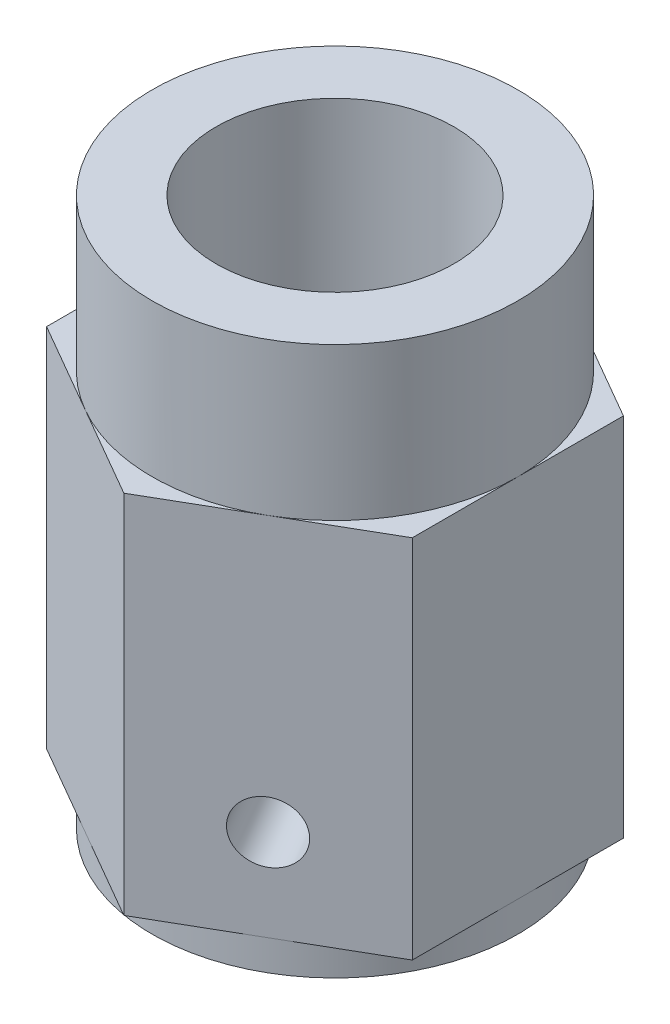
ISO-10303-21;
HEADER;
FILE_DESCRIPTION(('STEP AP214'),'2;1');
FILE_NAME('part.step','',(''),(''),'','','');
FILE_SCHEMA(('AUTOMOTIVE_DESIGN { 1 0 10303 214 1 1 1 1 }'));
ENDSEC;
DATA;
#1=APPLICATION_CONTEXT('core data for automotive mechanical design processes');
#2=APPLICATION_PROTOCOL_DEFINITION('international standard','automotive_design',2000,#1);
#3=PRODUCT_CONTEXT('',#1,'mechanical');
#4=PRODUCT('Part','Part','',(#3));
#5=PRODUCT_RELATED_PRODUCT_CATEGORY('part','',(#4));
#6=PRODUCT_DEFINITION_FORMATION('','',#4);
#7=PRODUCT_DEFINITION_CONTEXT('part definition',#1,'design');
#8=PRODUCT_DEFINITION('design','',#6,#7);
#9=PRODUCT_DEFINITION_SHAPE('','',#8);
#10=(LENGTH_UNIT() NAMED_UNIT(*) SI_UNIT(.MILLI.,.METRE.));
#11=(NAMED_UNIT(*) PLANE_ANGLE_UNIT() SI_UNIT($,.RADIAN.));
#12=(NAMED_UNIT(*) SI_UNIT($,.STERADIAN.) SOLID_ANGLE_UNIT());
#13=UNCERTAINTY_MEASURE_WITH_UNIT(LENGTH_MEASURE(1.E-05),#10,'distance_accuracy_value','');
#14=(GEOMETRIC_REPRESENTATION_CONTEXT(3) GLOBAL_UNCERTAINTY_ASSIGNED_CONTEXT((#13)) GLOBAL_UNIT_ASSIGNED_CONTEXT((#10,
#11,#12)) REPRESENTATION_CONTEXT('',''));
#15=CARTESIAN_POINT('',(0.,0.,0.));
#16=DIRECTION('',(0.,0.,1.));
#17=DIRECTION('',(1.,0.,0.));
#18=AXIS2_PLACEMENT_3D('',#15,#16,#17);
#19=CARTESIAN_POINT('',(0.,0.,0.));
#20=DIRECTION('',(0.,1.,0.));
#21=DIRECTION('',(0.,0.,1.));
#22=AXIS2_PLACEMENT_3D('',#19,#20,#21);
#23=PLANE('',#22);
#24=CARTESIAN_POINT('',(0.,0.,0.));
#25=DIRECTION('',(0.,-1.,0.));
#26=DIRECTION('',(0.,0.,-1.));
#27=AXIS2_PLACEMENT_3D('',#24,#25,#26);
#28=CIRCLE('',#27,30.);
#29=CARTESIAN_POINT('',(15.,0.,-25.9807621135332));
#30=VERTEX_POINT('',#29);
#31=CARTESIAN_POINT('',(30.,0.,0.));
#32=VERTEX_POINT('',#31);
#33=EDGE_CURVE('E49',#30,#32,#28,.T.);
#34=ORIENTED_EDGE('',*,*,#33,.F.);
#35=DIRECTION('',(-0.866025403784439,0.,-0.5));
#36=VECTOR('',#35,1.);
#37=CARTESIAN_POINT('',(30.,0.,-17.3205080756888));
#38=LINE('',#37,#36);
#39=CARTESIAN_POINT('',(30.,0.,-17.3205080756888));
#40=VERTEX_POINT('',#39);
#41=EDGE_CURVE('E133',#40,#30,#38,.T.);
#42=ORIENTED_EDGE('',*,*,#41,.F.);
#43=DIRECTION('',(0.,0.,-1.));
#44=VECTOR('',#43,1.);
#45=CARTESIAN_POINT('',(30.,0.,17.3205080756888));
#46=LINE('',#45,#44);
#47=EDGE_CURVE('E150',#32,#40,#46,.T.);
#48=ORIENTED_EDGE('',*,*,#47,.F.);
#49=EDGE_LOOP('',(#34,#42,#48));
#50=FACE_BOUND('',#49,.T.);
#51=ADVANCED_FACE('F38',(#50),#23,.F.);
#52=CARTESIAN_POINT('',(15.,0.,25.9807621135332));
#53=VERTEX_POINT('',#52);
#54=EDGE_CURVE('E11',#32,#53,#28,.T.);
#55=ORIENTED_EDGE('',*,*,#54,.F.);
#56=CARTESIAN_POINT('',(30.,0.,17.3205080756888));
#57=VERTEX_POINT('',#56);
#58=EDGE_CURVE('E206',#57,#32,#46,.T.);
#59=ORIENTED_EDGE('',*,*,#58,.F.);
#60=DIRECTION('',(0.866025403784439,0.,-0.5));
#61=VECTOR('',#60,1.);
#62=CARTESIAN_POINT('',(0.,0.,34.6410161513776));
#63=LINE('',#62,#61);
#64=EDGE_CURVE('E202',#53,#57,#63,.T.);
#65=ORIENTED_EDGE('',*,*,#64,.F.);
#66=EDGE_LOOP('',(#55,#59,#65));
#67=FACE_BOUND('',#66,.T.);
#68=ADVANCED_FACE('F245',(#67),#23,.F.);
#69=CARTESIAN_POINT('',(-15.,0.,25.9807621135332));
#70=VERTEX_POINT('',#69);
#71=EDGE_CURVE('E47',#53,#70,#28,.T.);
#72=ORIENTED_EDGE('',*,*,#71,.F.);
#73=CARTESIAN_POINT('',(0.,0.,34.6410161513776));
#74=VERTEX_POINT('',#73);
#75=EDGE_CURVE('E203',#74,#53,#63,.T.);
#76=ORIENTED_EDGE('',*,*,#75,.F.);
#77=DIRECTION('',(0.866025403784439,0.,0.5));
#78=VECTOR('',#77,1.);
#79=CARTESIAN_POINT('',(-30.,0.,17.3205080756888));
#80=LINE('',#79,#78);
#81=EDGE_CURVE('E198',#70,#74,#80,.T.);
#82=ORIENTED_EDGE('',*,*,#81,.F.);
#83=EDGE_LOOP('',(#72,#76,#82));
#84=FACE_BOUND('',#83,.T.);
#85=ADVANCED_FACE('F250',(#84),#23,.F.);
#86=CARTESIAN_POINT('',(-30.,0.,0.));
#87=VERTEX_POINT('',#86);
#88=EDGE_CURVE('E158',#70,#87,#28,.T.);
#89=ORIENTED_EDGE('',*,*,#88,.F.);
#90=CARTESIAN_POINT('',(-30.,0.,17.3205080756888));
#91=VERTEX_POINT('',#90);
#92=EDGE_CURVE('E199',#91,#70,#80,.T.);
#93=ORIENTED_EDGE('',*,*,#92,.F.);
#94=DIRECTION('',(0.,0.,1.));
#95=VECTOR('',#94,1.);
#96=CARTESIAN_POINT('',(-30.,0.,-17.3205080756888));
#97=LINE('',#96,#95);
#98=EDGE_CURVE('E194',#87,#91,#97,.T.);
#99=ORIENTED_EDGE('',*,*,#98,.F.);
#100=EDGE_LOOP('',(#89,#93,#99));
#101=FACE_BOUND('',#100,.T.);
#102=ADVANCED_FACE('F258',(#101),#23,.F.);
#103=CARTESIAN_POINT('',(-15.,0.,-25.9807621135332));
#104=VERTEX_POINT('',#103);
#105=EDGE_CURVE('E63',#87,#104,#28,.T.);
#106=ORIENTED_EDGE('',*,*,#105,.F.);
#107=CARTESIAN_POINT('',(-30.,0.,-17.3205080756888));
#108=VERTEX_POINT('',#107);
#109=EDGE_CURVE('E195',#108,#87,#97,.T.);
#110=ORIENTED_EDGE('',*,*,#109,.F.);
#111=DIRECTION('',(-0.866025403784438,0.,0.5));
#112=VECTOR('',#111,1.);
#113=CARTESIAN_POINT('',(0.,0.,-34.6410161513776));
#114=LINE('',#113,#112);
#115=EDGE_CURVE('E142',#104,#108,#114,.T.);
#116=ORIENTED_EDGE('',*,*,#115,.F.);
#117=EDGE_LOOP('',(#106,#110,#116));
#118=FACE_BOUND('',#117,.T.);
#119=ADVANCED_FACE('F260',(#118),#23,.F.);
#120=CARTESIAN_POINT('',(0.,60.,0.));
#121=DIRECTION('',(0.,1.,0.));
#122=DIRECTION('',(0.,0.,1.));
#123=AXIS2_PLACEMENT_3D('',#120,#121,#122);
#124=PLANE('',#123);
#125=CARTESIAN_POINT('',(0.,60.,0.));
#126=DIRECTION('',(0.,1.,0.));
#127=DIRECTION('',(0.,0.,1.));
#128=AXIS2_PLACEMENT_3D('',#125,#126,#127);
#129=CIRCLE('',#128,30.);
#130=CARTESIAN_POINT('',(15.,60.,25.9807621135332));
#131=VERTEX_POINT('',#130);
#132=CARTESIAN_POINT('',(30.,60.,0.));
#133=VERTEX_POINT('',#132);
#134=EDGE_CURVE('E162',#131,#133,#129,.T.);
#135=ORIENTED_EDGE('',*,*,#134,.F.);
#136=DIRECTION('',(0.866025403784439,0.,-0.5));
#137=VECTOR('',#136,1.);
#138=CARTESIAN_POINT('',(0.,60.,34.6410161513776));
#139=LINE('',#138,#137);
#140=CARTESIAN_POINT('',(30.,60.,17.3205080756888));
#141=VERTEX_POINT('',#140);
#142=EDGE_CURVE('E186',#131,#141,#139,.T.);
#143=ORIENTED_EDGE('',*,*,#142,.T.);
#144=DIRECTION('',(0.,0.,-1.));
#145=VECTOR('',#144,1.);
#146=CARTESIAN_POINT('',(30.,60.,17.3205080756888));
#147=LINE('',#146,#145);
#148=EDGE_CURVE('E190',#141,#133,#147,.T.);
#149=ORIENTED_EDGE('',*,*,#148,.T.);
#150=EDGE_LOOP('',(#135,#143,#149));
#151=FACE_BOUND('',#150,.T.);
#152=ADVANCED_FACE('F288',(#151),#124,.T.);
#153=CARTESIAN_POINT('',(15.,60.,-25.9807621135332));
#154=VERTEX_POINT('',#153);
#155=EDGE_CURVE('E157',#133,#154,#129,.T.);
#156=ORIENTED_EDGE('',*,*,#155,.F.);
#157=CARTESIAN_POINT('',(30.,60.,-17.3205080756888));
#158=VERTEX_POINT('',#157);
#159=EDGE_CURVE('E189',#133,#158,#147,.T.);
#160=ORIENTED_EDGE('',*,*,#159,.T.);
#161=DIRECTION('',(-0.866025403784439,0.,-0.5));
#162=VECTOR('',#161,1.);
#163=CARTESIAN_POINT('',(30.,60.,-17.3205080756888));
#164=LINE('',#163,#162);
#165=EDGE_CURVE('E170',#158,#154,#164,.T.);
#166=ORIENTED_EDGE('',*,*,#165,.T.);
#167=EDGE_LOOP('',(#156,#160,#166));
#168=FACE_BOUND('',#167,.T.);
#169=ADVANCED_FACE('F236',(#168),#124,.T.);
#170=CARTESIAN_POINT('',(-15.,60.,-25.9807621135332));
#171=VERTEX_POINT('',#170);
#172=EDGE_CURVE('E160',#154,#171,#129,.T.);
#173=ORIENTED_EDGE('',*,*,#172,.F.);
#174=CARTESIAN_POINT('',(0.,60.,-34.6410161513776));
#175=VERTEX_POINT('',#174);
#176=EDGE_CURVE('E174',#154,#175,#164,.T.);
#177=ORIENTED_EDGE('',*,*,#176,.T.);
#178=DIRECTION('',(-0.866025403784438,0.,0.5));
#179=VECTOR('',#178,1.);
#180=CARTESIAN_POINT('',(0.,60.,-34.6410161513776));
#181=LINE('',#180,#179);
#182=EDGE_CURVE('E175',#175,#171,#181,.T.);
#183=ORIENTED_EDGE('',*,*,#182,.T.);
#184=EDGE_LOOP('',(#173,#177,#183));
#185=FACE_BOUND('',#184,.T.);
#186=ADVANCED_FACE('F234',(#185),#124,.T.);
#187=CARTESIAN_POINT('',(-30.,60.,0.));
#188=VERTEX_POINT('',#187);
#189=EDGE_CURVE('E228',#171,#188,#129,.T.);
#190=ORIENTED_EDGE('',*,*,#189,.F.);
#191=CARTESIAN_POINT('',(-30.,60.,-17.3205080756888));
#192=VERTEX_POINT('',#191);
#193=EDGE_CURVE('E173',#171,#192,#181,.T.);
#194=ORIENTED_EDGE('',*,*,#193,.T.);
#195=DIRECTION('',(0.,0.,1.));
#196=VECTOR('',#195,1.);
#197=CARTESIAN_POINT('',(-30.,60.,-17.3205080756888));
#198=LINE('',#197,#196);
#199=EDGE_CURVE('E179',#192,#188,#198,.T.);
#200=ORIENTED_EDGE('',*,*,#199,.T.);
#201=EDGE_LOOP('',(#190,#194,#200));
#202=FACE_BOUND('',#201,.T.);
#203=ADVANCED_FACE('F336',(#202),#124,.T.);
#204=CARTESIAN_POINT('',(-15.,60.,25.9807621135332));
#205=VERTEX_POINT('',#204);
#206=EDGE_CURVE('E225',#188,#205,#129,.T.);
#207=ORIENTED_EDGE('',*,*,#206,.F.);
#208=CARTESIAN_POINT('',(-30.,60.,17.3205080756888));
#209=VERTEX_POINT('',#208);
#210=EDGE_CURVE('E178',#188,#209,#198,.T.);
#211=ORIENTED_EDGE('',*,*,#210,.T.);
#212=DIRECTION('',(0.866025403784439,0.,0.5));
#213=VECTOR('',#212,1.);
#214=CARTESIAN_POINT('',(-30.,60.,17.3205080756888));
#215=LINE('',#214,#213);
#216=EDGE_CURVE('E183',#209,#205,#215,.T.);
#217=ORIENTED_EDGE('',*,*,#216,.T.);
#218=EDGE_LOOP('',(#207,#211,#217));
#219=FACE_BOUND('',#218,.T.);
#220=ADVANCED_FACE('F269',(#219),#124,.T.);
#221=CARTESIAN_POINT('',(30.,60.,-17.3205080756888));
#222=DIRECTION('',(-0.5,0.,0.866025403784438));
#223=DIRECTION('',(0.866025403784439,0.,0.5));
#224=AXIS2_PLACEMENT_3D('',#221,#222,#223);
#225=PLANE('',#224);
#226=CARTESIAN_POINT('',(15.,15.,-25.9807621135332));
#227=DIRECTION('',(0.5,0.,-0.866025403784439));
#228=DIRECTION('',(-0.866025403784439,0.,-0.5));
#229=AXIS2_PLACEMENT_3D('',#226,#227,#228);
#230=CIRCLE('',#229,5.);
#231=CARTESIAN_POINT('',(10.6698729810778,15.,-28.4807621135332));
#232=VERTEX_POINT('',#231);
#233=EDGE_CURVE('E451',#232,#232,#230,.T.);
#234=ORIENTED_EDGE('',*,*,#233,.F.);
#235=EDGE_LOOP('',(#234));
#236=FACE_BOUND('',#235,.T.);
#237=ORIENTED_EDGE('',*,*,#41,.T.);
#238=CARTESIAN_POINT('',(0.,0.,-34.6410161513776));
#239=VERTEX_POINT('',#238);
#240=EDGE_CURVE('E135',#30,#239,#38,.T.);
#241=ORIENTED_EDGE('',*,*,#240,.T.);
#242=DIRECTION('',(0.,-1.,0.));
#243=VECTOR('',#242,1.);
#244=CARTESIAN_POINT('',(0.,60.,-34.6410161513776));
#245=LINE('',#244,#243);
#246=EDGE_CURVE('E42',#175,#239,#245,.T.);
#247=ORIENTED_EDGE('',*,*,#246,.F.);
#248=ORIENTED_EDGE('',*,*,#176,.F.);
#249=ORIENTED_EDGE('',*,*,#165,.F.);
#250=DIRECTION('',(0.,-1.,0.));
#251=VECTOR('',#250,1.);
#252=CARTESIAN_POINT('',(30.,60.,-17.3205080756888));
#253=LINE('',#252,#251);
#254=EDGE_CURVE('E138',#158,#40,#253,.T.);
#255=ORIENTED_EDGE('',*,*,#254,.T.);
#256=EDGE_LOOP('',(#237,#241,#247,#248,#249,#255));
#257=FACE_BOUND('',#256,.T.);
#258=ADVANCED_FACE('F40',(#236,#257),#225,.F.);
#259=CARTESIAN_POINT('',(0.,60.,-34.6410161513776));
#260=DIRECTION('',(0.5,0.,0.866025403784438));
#261=DIRECTION('',(0.866025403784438,0.,-0.5));
#262=AXIS2_PLACEMENT_3D('',#259,#260,#261);
#263=PLANE('',#262);
#264=EDGE_CURVE('E146',#239,#104,#114,.T.);
#265=ORIENTED_EDGE('',*,*,#264,.T.);
#266=ORIENTED_EDGE('',*,*,#115,.T.);
#267=DIRECTION('',(0.,-1.,0.));
#268=VECTOR('',#267,1.);
#269=CARTESIAN_POINT('',(-30.,60.,-17.3205080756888));
#270=LINE('',#269,#268);
#271=EDGE_CURVE('E217',#192,#108,#270,.T.);
#272=ORIENTED_EDGE('',*,*,#271,.F.);
#273=ORIENTED_EDGE('',*,*,#193,.F.);
#274=ORIENTED_EDGE('',*,*,#182,.F.);
#275=ORIENTED_EDGE('',*,*,#246,.T.);
#276=EDGE_LOOP('',(#265,#266,#272,#273,#274,#275));
#277=FACE_BOUND('',#276,.T.);
#278=ADVANCED_FACE('F261',(#277),#263,.F.);
#279=CARTESIAN_POINT('',(-30.,60.,-17.3205080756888));
#280=DIRECTION('',(1.,0.,0.));
#281=DIRECTION('',(0.,0.,-1.));
#282=AXIS2_PLACEMENT_3D('',#279,#280,#281);
#283=PLANE('',#282);
#284=CARTESIAN_POINT('',(-30.,15.,0.));
#285=DIRECTION('',(-1.,0.,0.));
#286=DIRECTION('',(0.,0.,1.));
#287=AXIS2_PLACEMENT_3D('',#284,#285,#286);
#288=CIRCLE('',#287,5.);
#289=CARTESIAN_POINT('',(-30.,15.,5.));
#290=VERTEX_POINT('',#289);
#291=EDGE_CURVE('E405',#290,#290,#288,.T.);
#292=ORIENTED_EDGE('',*,*,#291,.F.);
#293=EDGE_LOOP('',(#292));
#294=FACE_BOUND('',#293,.T.);
#295=ORIENTED_EDGE('',*,*,#109,.T.);
#296=ORIENTED_EDGE('',*,*,#98,.T.);
#297=DIRECTION('',(0.,-1.,0.));
#298=VECTOR('',#297,1.);
#299=CARTESIAN_POINT('',(-30.,60.,17.3205080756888));
#300=LINE('',#299,#298);
#301=EDGE_CURVE('E215',#209,#91,#300,.T.);
#302=ORIENTED_EDGE('',*,*,#301,.F.);
#303=ORIENTED_EDGE('',*,*,#210,.F.);
#304=ORIENTED_EDGE('',*,*,#199,.F.);
#305=ORIENTED_EDGE('',*,*,#271,.T.);
#306=EDGE_LOOP('',(#295,#296,#302,#303,#304,#305));
#307=FACE_BOUND('',#306,.T.);
#308=ADVANCED_FACE('F259',(#294,#307),#283,.F.);
#309=CARTESIAN_POINT('',(-30.,60.,17.3205080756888));
#310=DIRECTION('',(0.5,0.,-0.866025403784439));
#311=DIRECTION('',(-0.866025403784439,0.,-0.5));
#312=AXIS2_PLACEMENT_3D('',#309,#310,#311);
#313=PLANE('',#312);
#314=ORIENTED_EDGE('',*,*,#92,.T.);
#315=ORIENTED_EDGE('',*,*,#81,.T.);
#316=DIRECTION('',(0.,-1.,0.));
#317=VECTOR('',#316,1.);
#318=CARTESIAN_POINT('',(0.,60.,34.6410161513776));
#319=LINE('',#318,#317);
#320=CARTESIAN_POINT('',(0.,60.,34.6410161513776));
#321=VERTEX_POINT('',#320);
#322=EDGE_CURVE('E212',#321,#74,#319,.T.);
#323=ORIENTED_EDGE('',*,*,#322,.F.);
#324=EDGE_CURVE('E182',#205,#321,#215,.T.);
#325=ORIENTED_EDGE('',*,*,#324,.F.);
#326=ORIENTED_EDGE('',*,*,#216,.F.);
#327=ORIENTED_EDGE('',*,*,#301,.T.);
#328=EDGE_LOOP('',(#314,#315,#323,#325,#326,#327));
#329=FACE_BOUND('',#328,.T.);
#330=ADVANCED_FACE('F254',(#329),#313,.F.);
#331=CARTESIAN_POINT('',(0.,60.,34.6410161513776));
#332=DIRECTION('',(-0.5,0.,-0.866025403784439));
#333=DIRECTION('',(-0.866025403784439,0.,0.5));
#334=AXIS2_PLACEMENT_3D('',#331,#332,#333);
#335=PLANE('',#334);
#336=CARTESIAN_POINT('',(15.,15.,25.9807621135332));
#337=DIRECTION('',(0.5,0.,0.866025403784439));
#338=DIRECTION('',(0.866025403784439,0.,-0.5));
#339=AXIS2_PLACEMENT_3D('',#336,#337,#338);
#340=CIRCLE('',#339,5.);
#341=CARTESIAN_POINT('',(19.3301270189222,15.,23.4807621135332));
#342=VERTEX_POINT('',#341);
#343=EDGE_CURVE('E435',#342,#342,#340,.T.);
#344=ORIENTED_EDGE('',*,*,#343,.F.);
#345=EDGE_LOOP('',(#344));
#346=FACE_BOUND('',#345,.T.);
#347=ORIENTED_EDGE('',*,*,#75,.T.);
#348=ORIENTED_EDGE('',*,*,#64,.T.);
#349=DIRECTION('',(0.,-1.,0.));
#350=VECTOR('',#349,1.);
#351=CARTESIAN_POINT('',(30.,60.,17.3205080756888));
#352=LINE('',#351,#350);
#353=EDGE_CURVE('E209',#141,#57,#352,.T.);
#354=ORIENTED_EDGE('',*,*,#353,.F.);
#355=ORIENTED_EDGE('',*,*,#142,.F.);
#356=EDGE_CURVE('E187',#321,#131,#139,.T.);
#357=ORIENTED_EDGE('',*,*,#356,.F.);
#358=ORIENTED_EDGE('',*,*,#322,.T.);
#359=EDGE_LOOP('',(#347,#348,#354,#355,#357,#358));
#360=FACE_BOUND('',#359,.T.);
#361=ADVANCED_FACE('F460',(#346,#360),#335,.F.);
#362=CARTESIAN_POINT('',(30.,60.,17.3205080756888));
#363=DIRECTION('',(-1.,0.,0.));
#364=DIRECTION('',(0.,0.,1.));
#365=AXIS2_PLACEMENT_3D('',#362,#363,#364);
#366=PLANE('',#365);
#367=ORIENTED_EDGE('',*,*,#58,.T.);
#368=ORIENTED_EDGE('',*,*,#47,.T.);
#369=ORIENTED_EDGE('',*,*,#254,.F.);
#370=ORIENTED_EDGE('',*,*,#159,.F.);
#371=ORIENTED_EDGE('',*,*,#148,.F.);
#372=ORIENTED_EDGE('',*,*,#353,.T.);
#373=EDGE_LOOP('',(#367,#368,#369,#370,#371,#372));
#374=FACE_BOUND('',#373,.T.);
#375=ADVANCED_FACE('F240',(#374),#366,.F.);
#376=EDGE_CURVE('E169',#205,#131,#129,.T.);
#377=ORIENTED_EDGE('',*,*,#376,.F.);
#378=ORIENTED_EDGE('',*,*,#324,.T.);
#379=ORIENTED_EDGE('',*,*,#356,.T.);
#380=EDGE_LOOP('',(#377,#378,#379));
#381=FACE_BOUND('',#380,.T.);
#382=ADVANCED_FACE('F279',(#381),#124,.T.);
#383=EDGE_CURVE('E56',#104,#30,#28,.T.);
#384=ORIENTED_EDGE('',*,*,#383,.F.);
#385=ORIENTED_EDGE('',*,*,#264,.F.);
#386=ORIENTED_EDGE('',*,*,#240,.F.);
#387=EDGE_LOOP('',(#384,#385,#386));
#388=FACE_BOUND('',#387,.T.);
#389=ADVANCED_FACE('F144',(#388),#23,.F.);
#390=CARTESIAN_POINT('',(0.,85.,0.));
#391=DIRECTION('',(0.,-1.,0.));
#392=DIRECTION('',(0.,0.,-1.));
#393=AXIS2_PLACEMENT_3D('',#390,#391,#392);
#394=CYLINDRICAL_SURFACE('',#393,30.);
#395=CARTESIAN_POINT('',(0.,85.,0.));
#396=DIRECTION('',(0.,1.,0.));
#397=DIRECTION('',(0.,0.,1.));
#398=AXIS2_PLACEMENT_3D('',#395,#396,#397);
#399=CIRCLE('',#398,30.);
#400=CARTESIAN_POINT('',(0.,85.,30.));
#401=VERTEX_POINT('',#400);
#402=EDGE_CURVE('E148',#401,#401,#399,.T.);
#403=ORIENTED_EDGE('',*,*,#402,.F.);
#404=EDGE_LOOP('',(#403));
#405=FACE_BOUND('',#404,.T.);
#406=ORIENTED_EDGE('',*,*,#134,.T.);
#407=ORIENTED_EDGE('',*,*,#155,.T.);
#408=ORIENTED_EDGE('',*,*,#172,.T.);
#409=ORIENTED_EDGE('',*,*,#189,.T.);
#410=ORIENTED_EDGE('',*,*,#206,.T.);
#411=ORIENTED_EDGE('',*,*,#376,.T.);
#412=EDGE_LOOP('',(#406,#407,#408,#409,#410,#411));
#413=FACE_BOUND('',#412,.T.);
#414=ADVANCED_FACE('F231',(#405,#413),#394,.T.);
#415=CARTESIAN_POINT('',(0.,85.,0.));
#416=DIRECTION('',(0.,1.,0.));
#417=DIRECTION('',(0.,0.,1.));
#418=AXIS2_PLACEMENT_3D('',#415,#416,#417);
#419=PLANE('',#418);
#420=CARTESIAN_POINT('',(0.,85.,0.));
#421=DIRECTION('',(0.,1.,0.));
#422=DIRECTION('',(0.,0.,1.));
#423=AXIS2_PLACEMENT_3D('',#420,#421,#422);
#424=CIRCLE('',#423,19.5);
#425=CARTESIAN_POINT('',(0.,85.,19.5));
#426=VERTEX_POINT('',#425);
#427=EDGE_CURVE('E404',#426,#426,#424,.T.);
#428=ORIENTED_EDGE('',*,*,#427,.F.);
#429=EDGE_LOOP('',(#428));
#430=FACE_BOUND('',#429,.T.);
#431=ORIENTED_EDGE('',*,*,#402,.T.);
#432=EDGE_LOOP('',(#431));
#433=FACE_BOUND('',#432,.T.);
#434=ADVANCED_FACE('F284',(#430,#433),#419,.T.);
#435=CARTESIAN_POINT('',(0.,-5.,0.));
#436=DIRECTION('',(0.,1.,0.));
#437=DIRECTION('',(0.,0.,1.));
#438=AXIS2_PLACEMENT_3D('',#435,#436,#437);
#439=CYLINDRICAL_SURFACE('',#438,30.);
#440=CARTESIAN_POINT('',(0.,-5.,0.));
#441=DIRECTION('',(0.,-1.,0.));
#442=DIRECTION('',(0.,0.,-1.));
#443=AXIS2_PLACEMENT_3D('',#440,#441,#442);
#444=CIRCLE('',#443,30.);
#445=CARTESIAN_POINT('',(0.,-5.,-30.));
#446=VERTEX_POINT('',#445);
#447=EDGE_CURVE('E153',#446,#446,#444,.T.);
#448=ORIENTED_EDGE('',*,*,#447,.F.);
#449=EDGE_LOOP('',(#448));
#450=FACE_BOUND('',#449,.T.);
#451=ORIENTED_EDGE('',*,*,#33,.T.);
#452=ORIENTED_EDGE('',*,*,#54,.T.);
#453=ORIENTED_EDGE('',*,*,#71,.T.);
#454=ORIENTED_EDGE('',*,*,#88,.T.);
#455=ORIENTED_EDGE('',*,*,#105,.T.);
#456=ORIENTED_EDGE('',*,*,#383,.T.);
#457=EDGE_LOOP('',(#451,#452,#453,#454,#455,#456));
#458=FACE_BOUND('',#457,.T.);
#459=ADVANCED_FACE('F155',(#450,#458),#439,.T.);
#460=CARTESIAN_POINT('',(0.,-5.,0.));
#461=DIRECTION('',(0.,-1.,0.));
#462=DIRECTION('',(0.,0.,-1.));
#463=AXIS2_PLACEMENT_3D('',#460,#461,#462);
#464=PLANE('',#463);
#465=CARTESIAN_POINT('',(0.,-5.,0.));
#466=DIRECTION('',(0.,-1.,0.));
#467=DIRECTION('',(0.,0.,-1.));
#468=AXIS2_PLACEMENT_3D('',#465,#466,#467);
#469=CIRCLE('',#468,15.);
#470=CARTESIAN_POINT('',(0.,-5.,-15.));
#471=VERTEX_POINT('',#470);
#472=EDGE_CURVE('E154',#471,#471,#469,.T.);
#473=ORIENTED_EDGE('',*,*,#472,.F.);
#474=EDGE_LOOP('',(#473));
#475=FACE_BOUND('',#474,.T.);
#476=ORIENTED_EDGE('',*,*,#447,.T.);
#477=EDGE_LOOP('',(#476));
#478=FACE_BOUND('',#477,.T.);
#479=ADVANCED_FACE('F372',(#475,#478),#464,.T.);
#480=CARTESIAN_POINT('',(0.,40.,0.));
#481=DIRECTION('',(0.,-1.,0.));
#482=DIRECTION('',(0.,0.,-1.));
#483=AXIS2_PLACEMENT_3D('',#480,#481,#482);
#484=CYLINDRICAL_SURFACE('',#483,15.);
#485=CARTESIAN_POINT('',(2.74094079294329,15.,-14.7474487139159));
#486=CARTESIAN_POINT('',(2.7409392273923,14.7276591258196,-14.7474485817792));
#487=CARTESIAN_POINT('',(2.7642521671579,14.455326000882,-14.7431730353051));
#488=CARTESIAN_POINT('',(2.85621974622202,13.9187278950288,-14.7256290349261));
#489=CARTESIAN_POINT('',(2.92488185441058,13.6544642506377,-14.7123590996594));
#490=CARTESIAN_POINT('',(3.10387971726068,13.1418655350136,-14.6756322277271));
#491=CARTESIAN_POINT('',(3.21413379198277,12.8935003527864,-14.6521952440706));
#492=CARTESIAN_POINT('',(3.47146220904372,12.4181997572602,-14.5933652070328));
#493=CARTESIAN_POINT('',(3.61854467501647,12.1912690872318,-14.5579695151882));
#494=CARTESIAN_POINT('',(3.94975384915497,11.7564001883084,-14.4716858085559));
#495=CARTESIAN_POINT('',(4.13501077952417,11.5494228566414,-14.42029217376));
#496=CARTESIAN_POINT('',(4.53246809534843,11.1689659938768,-14.3003416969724));
#497=CARTESIAN_POINT('',(4.74467279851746,10.9954918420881,-14.231782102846));
#498=CARTESIAN_POINT('',(5.19485467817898,10.682605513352,-14.073797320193));
#499=CARTESIAN_POINT('',(5.43335983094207,10.5442001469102,-13.9838743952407));
#500=CARTESIAN_POINT('',(5.92316770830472,10.3120420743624,-13.7835396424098));
#501=CARTESIAN_POINT('',(6.1744669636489,10.2182773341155,-13.6731333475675));
#502=CARTESIAN_POINT('',(6.67228822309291,10.081320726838,-13.4370303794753));
#503=CARTESIAN_POINT('',(6.91867222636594,10.036482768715,-13.3119993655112));
#504=CARTESIAN_POINT('',(7.40713565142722,9.9934185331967,-13.0465140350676));
#505=CARTESIAN_POINT('',(7.64921616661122,9.99518024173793,-12.9060637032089));
#506=CARTESIAN_POINT('',(8.11230738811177,10.0442212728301,-12.6198934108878));
#507=CARTESIAN_POINT('',(8.33377208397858,10.0897126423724,-12.4745961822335));
#508=CARTESIAN_POINT('',(8.76030230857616,10.2219649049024,-12.1788542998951));
#509=CARTESIAN_POINT('',(8.96536672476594,10.3087285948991,-12.0284092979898));
#510=CARTESIAN_POINT('',(9.35744889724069,10.5221065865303,-11.7260521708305));
#511=CARTESIAN_POINT('',(9.54419402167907,10.6492296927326,-11.5741467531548));
#512=CARTESIAN_POINT('',(9.89358657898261,10.9392985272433,-11.2769513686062));
#513=CARTESIAN_POINT('',(10.0562272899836,11.1022542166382,-11.1316632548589));
#514=CARTESIAN_POINT('',(10.3624817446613,11.4683719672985,-10.8473362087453));
#515=CARTESIAN_POINT('',(10.5048391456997,11.6730657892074,-10.7089135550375));
#516=CARTESIAN_POINT('',(10.7594278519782,12.1122436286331,-10.4531031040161));
#517=CARTESIAN_POINT('',(10.8716545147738,12.3467322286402,-10.3357185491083));
#518=CARTESIAN_POINT('',(11.0661436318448,12.8432681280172,-10.1272484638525));
#519=CARTESIAN_POINT('',(11.1479560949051,13.1056606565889,-10.0365617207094));
#520=CARTESIAN_POINT('',(11.2782028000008,13.6478569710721,-9.88998833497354));
#521=CARTESIAN_POINT('',(11.326651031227,13.9276534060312,-9.83408710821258));
#522=CARTESIAN_POINT('',(11.3879957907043,14.4831917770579,-9.76297448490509));
#523=CARTESIAN_POINT('',(11.4023976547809,14.7585471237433,-9.74604111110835));
#524=CARTESIAN_POINT('',(11.3998353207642,15.3088807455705,-9.74903958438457));
#525=CARTESIAN_POINT('',(11.3828768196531,15.5838590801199,-9.76896473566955));
#526=CARTESIAN_POINT('',(11.3190215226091,16.1157848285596,-9.84286385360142));
#527=CARTESIAN_POINT('',(11.2731731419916,16.3730271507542,-9.89564470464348));
#528=CARTESIAN_POINT('',(11.1531628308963,16.8727180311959,-10.0307060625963));
#529=CARTESIAN_POINT('',(11.0789958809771,17.1151639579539,-10.1129917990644));
#530=CARTESIAN_POINT('',(10.9003947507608,17.586902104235,-10.3052941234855));
#531=CARTESIAN_POINT('',(10.7950751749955,17.815533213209,-10.4161074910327));
#532=CARTESIAN_POINT('',(10.5562368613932,18.2457302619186,-10.6580822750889));
#533=CARTESIAN_POINT('',(10.4227098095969,18.4472881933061,-10.7892496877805));
#534=CARTESIAN_POINT('',(10.121669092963,18.8276399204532,-11.0723280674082));
#535=CARTESIAN_POINT('',(9.95282935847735,19.0048719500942,-11.2249334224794));
#536=CARTESIAN_POINT('',(9.58779783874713,19.3195807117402,-11.5382800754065));
#537=CARTESIAN_POINT('',(9.39160702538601,19.4570588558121,-11.6990210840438));
#538=CARTESIAN_POINT('',(8.97669175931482,19.6871005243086,-12.0202875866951));
#539=CARTESIAN_POINT('',(8.75812567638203,19.7799563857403,-12.1808074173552));
#540=CARTESIAN_POINT('',(8.30251436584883,19.9186387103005,-12.4957920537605));
#541=CARTESIAN_POINT('',(8.06547584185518,19.9644821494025,-12.6502590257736));
#542=CARTESIAN_POINT('',(7.59117962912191,20.0063103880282,-12.9401554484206));
#543=CARTESIAN_POINT('',(7.35445585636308,20.0045372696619,-13.0761384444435));
#544=CARTESIAN_POINT('',(6.87744560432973,19.956713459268,-13.3331966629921));
#545=CARTESIAN_POINT('',(6.63715941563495,19.9106663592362,-13.4542730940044));
#546=CARTESIAN_POINT('',(6.16430238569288,19.7770888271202,-13.6773061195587));
#547=CARTESIAN_POINT('',(5.9316696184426,19.6902289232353,-13.7795358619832));
#548=CARTESIAN_POINT('',(5.47712585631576,19.4781123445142,-13.966443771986));
#549=CARTESIAN_POINT('',(5.25521680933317,19.3528487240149,-14.0511187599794));
#550=CARTESIAN_POINT('',(4.82077704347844,19.06215243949,-14.2061709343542));
#551=CARTESIAN_POINT('',(4.60889580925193,18.8954065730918,-14.2759042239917));
#552=CARTESIAN_POINT('',(4.21041861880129,18.528713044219,-14.3984692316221));
#553=CARTESIAN_POINT('',(4.02383076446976,18.3287547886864,-14.4512955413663));
#554=CARTESIAN_POINT('',(3.67565609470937,17.8919532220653,-14.543841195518));
#555=CARTESIAN_POINT('',(3.51533386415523,17.6539724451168,-14.5829665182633));
#556=CARTESIAN_POINT('',(3.23570886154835,17.1533278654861,-14.6475555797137));
#557=CARTESIAN_POINT('',(3.11639537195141,16.8906705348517,-14.6730228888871));
#558=CARTESIAN_POINT('',(2.92896715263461,16.3601908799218,-14.7115582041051));
#559=CARTESIAN_POINT('',(2.85878193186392,16.0931386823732,-14.7251346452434));
#560=CARTESIAN_POINT('',(2.76477754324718,15.5507197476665,-14.7430783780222));
#561=CARTESIAN_POINT('',(2.74094237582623,15.2753559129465,-14.7474488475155));
#562=CARTESIAN_POINT('',(2.74094079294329,15.,-14.7474487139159));
#563=B_SPLINE_CURVE_WITH_KNOTS('',3,(#485,#486,#487,#488,#489,#490,#491,#492,#493,#494,#495,
#496,#497,#498,#499,#500,#501,#502,#503,#504,#505,#506,#507,#508,#509,#510,#511,#512,#513,#514,
#515,#516,#517,#518,#519,#520,#521,#522,#523,#524,#525,#526,#527,#528,#529,#530,#531,#532,#533,
#534,#535,#536,#537,#538,#539,#540,#541,#542,#543,#544,#545,#546,#547,#548,#549,#550,#551,#552,
#553,#554,#555,#556,#557,#558,#559,#560,#561,#562),.UNSPECIFIED.,.T.,.F.,(4,2,2,2,2,2,2,2,2,2,2,
2,2,2,2,2,2,2,2,2,2,2,2,2,2,2,2,2,2,2,2,2,2,2,2,2,2,2,4),(0.,0.816002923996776,1.63214027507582,
2.44668313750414,3.26140583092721,4.10506687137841,4.9488632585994,5.81467530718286,
6.68025381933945,7.51571593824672,8.35096266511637,9.15345024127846,9.95599220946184,
10.7690827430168,11.5823995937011,12.4340087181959,13.2857489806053,14.1496319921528,
15.0131525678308,15.837714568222,16.6621267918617,17.4582197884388,18.2544539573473,
19.0759428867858,19.8976742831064,20.7589404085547,21.6201759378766,22.4756895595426,
23.3308941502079,24.1459042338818,24.9608482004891,25.7628478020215,26.5649925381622,
27.3967759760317,28.2288252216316,29.0934451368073,29.9578389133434,30.7831606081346,
31.6081973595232),.UNSPECIFIED.);
#564=CARTESIAN_POINT('',(2.74094079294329,15.,-14.7474487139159));
#565=VERTEX_POINT('',#564);
#566=EDGE_CURVE('E446',#565,#565,#563,.T.);
#567=ORIENTED_EDGE('',*,*,#566,.F.);
#568=EDGE_LOOP('',(#567));
#569=FACE_BOUND('',#568,.T.);
#570=CARTESIAN_POINT('',(11.4011948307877,15.,9.7474487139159));
#571=CARTESIAN_POINT('',(11.4011954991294,14.7276591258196,9.74744729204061));
#572=CARTESIAN_POINT('',(11.385836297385,14.455326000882,9.76549911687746));
#573=CARTESIAN_POINT('',(11.3246589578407,13.9187278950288,9.83637337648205));
#574=CARTESIAN_POINT('',(11.2788358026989,13.6544642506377,9.88920153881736));
#575=CARTESIAN_POINT('',(11.1575304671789,13.1418655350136,10.0258547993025));
#576=CARTESIAN_POINT('',(11.0821064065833,12.8935003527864,10.1096191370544));
#577=CARTESIAN_POINT('',(10.9024938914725,12.4181997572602,10.3030570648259));
#578=CARTESIAN_POINT('',(10.7982990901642,12.1912690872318,10.4127363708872));
#579=CARTESIAN_POINT('',(10.5579706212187,11.7564001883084,10.6564300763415));
#580=CARTESIAN_POINT('',(10.420833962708,11.5494228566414,10.7911704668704));
#581=CARTESIAN_POINT('',(10.1182251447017,11.1689659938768,11.0754033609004));
#582=CARTESIAN_POINT('',(9.95274844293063,10.9954918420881,11.2248982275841));
#583=CARTESIAN_POINT('',(9.59083866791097,10.682605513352,11.5357747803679));
#584=CARTESIAN_POINT('',(9.39371055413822,10.5442001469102,11.6973648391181));
#585=CARTESIAN_POINT('',(8.97531163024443,10.3120420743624,12.0213835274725));
#586=CARTESIAN_POINT('',(8.75404734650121,10.2182773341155,12.1838119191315));
#587=CARTESIAN_POINT('',(8.30066554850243,10.081320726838,12.4968862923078));
#588=CARTESIAN_POINT('',(8.06919351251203,10.036482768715,12.6477455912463));
#589=CARTESIAN_POINT('',(7.59504475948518,9.9934185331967,12.9380246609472));
#590=CARTESIAN_POINT('',(7.35237094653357,9.99518024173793,13.0774473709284));
#591=CARTESIAN_POINT('',(6.87299459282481,10.0442212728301,13.3354109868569));
#592=CARTESIAN_POINT('',(6.63643115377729,10.0897126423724,13.4545564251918));
#593=CARTESIAN_POINT('',(6.16704605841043,10.2219649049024,13.676071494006));
#594=CARTESIAN_POINT('',(5.93422465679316,10.3087285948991,13.7784399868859));
#595=CARTESIAN_POINT('',(5.47633461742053,10.5221065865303,13.9668145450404));
#596=CARTESIAN_POINT('',(5.25140810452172,10.6492296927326,14.052587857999));
#597=CARTESIAN_POINT('',(4.81933307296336,10.9392985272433,14.2065729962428));
#598=CARTESIAN_POINT('',(4.61218952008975,11.1022542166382,14.2747799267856));
#599=CARTESIAN_POINT('',(4.21282784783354,11.4683719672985,14.3978405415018));
#600=CARTESIAN_POINT('',(4.02177161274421,11.6730657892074,14.4519143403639));
#601=CARTESIAN_POINT('',(3.67293891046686,12.1122436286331,14.544489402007));
#602=CARTESIAN_POINT('',(3.51516757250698,12.3467322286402,14.5829882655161));
#603=CARTESIAN_POINT('',(3.23738262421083,12.8432681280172,14.6471857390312));
#604=CARTESIAN_POINT('',(3.11793936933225,13.1056606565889,14.6726940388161));
#605=CARTESIAN_POINT('',(2.92587974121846,13.6478569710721,14.7122043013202));
#606=CARTESIAN_POINT('',(2.85324374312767,13.9276534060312,14.7262110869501));
#607=CARTESIAN_POINT('',(2.76098602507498,14.4831917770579,14.7437808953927));
#608=CARTESIAN_POINT('',(2.73912036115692,14.7585471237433,14.7477865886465));
#609=CARTESIAN_POINT('',(2.74299828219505,15.3088807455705,14.7470667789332));
#610=CARTESIAN_POINT('',(2.76873321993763,15.5838590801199,14.7423428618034));
#611=CARTESIAN_POINT('',(2.8646593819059,16.1157848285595,14.723992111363));
#612=CARTESIAN_POINT('',(2.93329313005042,16.3730271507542,14.7106766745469));
#613=CARTESIAN_POINT('',(3.1102648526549,16.8727180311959,14.6742753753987));
#614=CARTESIAN_POINT('',(3.2186098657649,17.1151639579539,14.6511877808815));
#615=CARTESIAN_POINT('',(3.4744491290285,17.586902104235,14.5926658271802));
#616=CARTESIAN_POINT('',(3.62307610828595,17.815533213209,14.5568630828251));
#617=CARTESIAN_POINT('',(3.95205157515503,18.2457302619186,14.4710104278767));
#618=CARTESIAN_POINT('',(4.13240941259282,18.4472881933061,14.4209563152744));
#619=CARTESIAN_POINT('',(4.52808283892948,18.8276399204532,14.3017865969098));
#620=CARTESIAN_POINT('',(4.74466282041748,19.0048719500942,14.2318697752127));
#621=CARTESIAN_POINT('',(5.19854474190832,19.3195807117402,14.0724165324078));
#622=CARTESIAN_POINT('',(5.43584594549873,19.4570588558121,13.9828808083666));
#623=CARTESIAN_POINT('',(5.92152853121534,19.6871005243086,13.7841868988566));
#624=CARTESIAN_POINT('',(6.16982582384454,19.7799563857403,13.6751630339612));
#625=CARTESIAN_POINT('',(6.6704161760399,19.9186387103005,13.4380843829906));
#626=CARTESIAN_POINT('',(6.92270775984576,19.9644821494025,13.3100364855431));
#627=CARTESIAN_POINT('',(7.41091353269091,20.0063103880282,13.0442321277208));
#628=CARTESIAN_POINT('',(7.64704014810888,20.0045372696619,12.9072148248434));
#629=CARTESIAN_POINT('',(8.10816422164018,19.956713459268,12.6226409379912));
#630=CARTESIAN_POINT('',(8.33316258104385,19.9106663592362,12.4750852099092));
#631=CARTESIAN_POINT('',(8.76274336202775,19.7770888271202,12.1770955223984));
#632=CARTESIAN_POINT('',(8.96759329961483,19.6902289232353,12.0267445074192));
#633=CARTESIAN_POINT('',(9.356732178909,19.4781123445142,11.7265520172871));
#634=CARTESIAN_POINT('',(9.54101739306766,19.3528487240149,11.5767106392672));
#635=CARTESIAN_POINT('',(9.89251639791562,19.06215243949,11.2780008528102));
#636=CARTESIAN_POINT('',(10.0588478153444,18.8954065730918,11.1293729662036));
#637=CARTESIAN_POINT('',(10.3642308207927,18.528713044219,10.8455641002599));
#638=CARTESIAN_POINT('',(10.5032736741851,18.3287547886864,10.7103874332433));
#639=CARTESIAN_POINT('',(10.7575078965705,17.8919532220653,10.4551321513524));
#640=CARTESIAN_POINT('',(10.8715525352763,17.6539724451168,10.3358516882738));
#641=CARTESIAN_POINT('',(11.0673008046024,17.1533278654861,10.1259838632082));
#642=CARTESIAN_POINT('',(11.1490128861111,16.8906705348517,10.0353890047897));
#643=CARTESIAN_POINT('',(11.2760995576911,16.3601908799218,9.89233906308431));
#644=CARTESIAN_POINT('',(11.3229497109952,16.0931386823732,9.8383450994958));
#645=CARTESIAN_POINT('',(11.3854916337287,15.5507197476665,9.76590677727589));
#646=CARTESIAN_POINT('',(11.4011941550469,15.2753559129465,9.74745015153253));
#647=CARTESIAN_POINT('',(11.4011948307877,15.,9.7474487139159));
#648=B_SPLINE_CURVE_WITH_KNOTS('',3,(#570,#571,#572,#573,#574,#575,#576,#577,#578,#579,#580,
#581,#582,#583,#584,#585,#586,#587,#588,#589,#590,#591,#592,#593,#594,#595,#596,#597,#598,#599,
#600,#601,#602,#603,#604,#605,#606,#607,#608,#609,#610,#611,#612,#613,#614,#615,#616,#617,#618,
#619,#620,#621,#622,#623,#624,#625,#626,#627,#628,#629,#630,#631,#632,#633,#634,#635,#636,#637,
#638,#639,#640,#641,#642,#643,#644,#645,#646,#647),.UNSPECIFIED.,.T.,.F.,(4,2,2,2,2,2,2,2,2,2,2,
2,2,2,2,2,2,2,2,2,2,2,2,2,2,2,2,2,2,2,2,2,2,2,2,2,2,2,4),(0.,0.816002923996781,1.63214027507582,
2.44668313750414,3.26140583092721,4.10506687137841,4.9488632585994,5.81467530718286,
6.68025381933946,7.51571593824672,8.35096266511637,9.15345024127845,9.95599220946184,
10.7690827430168,11.5823995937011,12.4340087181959,13.2857489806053,14.1496319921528,
15.0131525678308,15.837714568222,16.6621267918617,17.4582197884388,18.2544539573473,
19.0759428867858,19.8976742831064,20.7589404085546,21.6201759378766,22.4756895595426,
23.3308941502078,24.1459042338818,24.9608482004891,25.7628478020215,26.5649925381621,
27.3967759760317,28.2288252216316,29.0934451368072,29.9578389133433,30.7831606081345,
31.6081973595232),.UNSPECIFIED.);
#649=CARTESIAN_POINT('',(11.4011948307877,15.,9.7474487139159));
#650=VERTEX_POINT('',#649);
#651=EDGE_CURVE('E429',#650,#650,#648,.T.);
#652=ORIENTED_EDGE('',*,*,#651,.F.);
#653=EDGE_LOOP('',(#652));
#654=FACE_BOUND('',#653,.T.);
#655=CARTESIAN_POINT('',(-14.142135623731,15.,5.));
#656=CARTESIAN_POINT('',(-14.1421347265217,14.7276591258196,5.00000128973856));
#657=CARTESIAN_POINT('',(-14.1500884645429,14.455326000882,4.97767391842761));
#658=CARTESIAN_POINT('',(-14.1808787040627,13.9187278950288,4.88925565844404));
#659=CARTESIAN_POINT('',(-14.2037176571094,13.6544642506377,4.82315756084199));
#660=CARTESIAN_POINT('',(-14.2614101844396,13.1418655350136,4.64977742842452));
#661=CARTESIAN_POINT('',(-14.2962401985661,12.8935003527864,4.54257610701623));
#662=CARTESIAN_POINT('',(-14.3739561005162,12.4181997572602,4.2903081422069));
#663=CARTESIAN_POINT('',(-14.4168437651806,12.1912690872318,4.14523314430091));
#664=CARTESIAN_POINT('',(-14.5077244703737,11.7564001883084,3.81525573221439));
#665=CARTESIAN_POINT('',(-14.5558447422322,11.5494228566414,3.62912170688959));
#666=CARTESIAN_POINT('',(-14.6506932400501,11.1689659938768,3.22493833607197));
#667=CARTESIAN_POINT('',(-14.6974212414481,10.9954918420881,3.00688387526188));
#668=CARTESIAN_POINT('',(-14.7856933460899,10.682605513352,2.53802253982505));
#669=CARTESIAN_POINT('',(-14.8270703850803,10.5442001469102,2.28650955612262));
#670=CARTESIAN_POINT('',(-14.8984793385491,10.3120420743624,1.76215611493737));
#671=CARTESIAN_POINT('',(-14.9285143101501,10.2182773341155,1.48932142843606));
#672=CARTESIAN_POINT('',(-14.9729537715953,10.081320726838,0.940144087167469));
#673=CARTESIAN_POINT('',(-14.987865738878,10.036482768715,0.66425377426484));
#674=CARTESIAN_POINT('',(-15.0021804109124,9.9934185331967,0.108489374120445));
#675=CARTESIAN_POINT('',(-15.0015871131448,9.99518024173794,-0.171383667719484));
#676=CARTESIAN_POINT('',(-14.9853019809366,10.0442212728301,-0.715517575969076));
#677=CARTESIAN_POINT('',(-14.9702032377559,10.0897126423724,-0.979960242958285));
#678=CARTESIAN_POINT('',(-14.9273483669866,10.2219649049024,-1.49721719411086));
#679=CARTESIAN_POINT('',(-14.8995913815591,10.3087285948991,-1.75003068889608));
#680=CARTESIAN_POINT('',(-14.8337835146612,10.5221065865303,-2.24076237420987));
#681=CARTESIAN_POINT('',(-14.7956021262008,10.6492296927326,-2.47844110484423));
#682=CARTESIAN_POINT('',(-14.712919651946,10.9392985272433,-2.92962162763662));
#683=CARTESIAN_POINT('',(-14.6684168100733,11.1022542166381,-3.14311667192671));
#684=CARTESIAN_POINT('',(-14.5753095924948,11.4683719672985,-3.55050433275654));
#685=CARTESIAN_POINT('',(-14.5266107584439,11.6730657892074,-3.74300078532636));
#686=CARTESIAN_POINT('',(-14.432366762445,12.1122436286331,-4.09138629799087));
#687=CARTESIAN_POINT('',(-14.3868220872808,12.3467322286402,-4.24726971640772));
#688=CARTESIAN_POINT('',(-14.3035262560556,12.8432681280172,-4.51993727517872));
#689=CARTESIAN_POINT('',(-14.2658954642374,13.1056606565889,-4.6361323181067));
#690=CARTESIAN_POINT('',(-14.2040825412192,13.6478569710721,-4.82221596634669));
#691=CARTESIAN_POINT('',(-14.1798947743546,13.9276534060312,-4.89212397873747));
#692=CARTESIAN_POINT('',(-14.1489818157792,14.4831917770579,-4.98080641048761));
#693=CARTESIAN_POINT('',(-14.1415180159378,14.7585471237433,-5.00174547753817));
#694=CARTESIAN_POINT('',(-14.1428336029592,15.3088807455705,-4.9980271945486));
#695=CARTESIAN_POINT('',(-14.1516100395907,15.5838590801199,-4.97337812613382));
#696=CARTESIAN_POINT('',(-14.183680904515,16.1157848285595,-4.88112825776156));
#697=CARTESIAN_POINT('',(-14.206466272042,16.3730271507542,-4.81503196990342));
#698=CARTESIAN_POINT('',(-14.2634276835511,16.8727180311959,-4.64356931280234));
#699=CARTESIAN_POINT('',(-14.297605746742,17.1151639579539,-4.53819598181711));
#700=CARTESIAN_POINT('',(-14.3748438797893,17.586902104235,-4.28737170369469));
#701=CARTESIAN_POINT('',(-14.4181512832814,17.815533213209,-4.14075559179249));
#702=CARTESIAN_POINT('',(-14.5082884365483,18.2457302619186,-3.8129281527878));
#703=CARTESIAN_POINT('',(-14.5551192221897,18.4472881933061,-3.63170662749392));
#704=CARTESIAN_POINT('',(-14.6497519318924,18.8276399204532,-3.22945852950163));
#705=CARTESIAN_POINT('',(-14.6974921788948,19.0048719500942,-3.00693635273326));
#706=CARTESIAN_POINT('',(-14.7863425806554,19.3195807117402,-2.53413645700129));
#707=CARTESIAN_POINT('',(-14.8274529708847,19.4570588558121,-2.28385972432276));
#708=CARTESIAN_POINT('',(-14.8982202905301,19.6871005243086,-1.76389931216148));
#709=CARTESIAN_POINT('',(-14.9279515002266,19.7799563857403,-1.49435561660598));
#710=CARTESIAN_POINT('',(-14.9729305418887,19.9186387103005,-0.942292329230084));
#711=CARTESIAN_POINT('',(-14.9881836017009,19.9644821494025,-0.659777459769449));
#712=CARTESIAN_POINT('',(-15.0020931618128,20.0063103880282,-0.104076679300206));
#713=CARTESIAN_POINT('',(-15.001496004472,20.0045372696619,0.168923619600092));
#714=CARTESIAN_POINT('',(-14.9856098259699,19.956713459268,0.710555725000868));
#715=CARTESIAN_POINT('',(-14.9703219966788,19.9106663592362,0.979187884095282));
#716=CARTESIAN_POINT('',(-14.9270457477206,19.7770888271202,1.50021059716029));
#717=CARTESIAN_POINT('',(-14.8992629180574,19.6902289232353,1.75279135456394));
#718=CARTESIAN_POINT('',(-14.8338580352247,19.4781123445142,2.23989175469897));
#719=CARTESIAN_POINT('',(-14.7962342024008,19.3528487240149,2.47440812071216));
#720=CARTESIAN_POINT('',(-14.713293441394,19.06215243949,2.92817008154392));
#721=CARTESIAN_POINT('',(-14.6677436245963,18.8954065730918,3.14653125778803));
#722=CARTESIAN_POINT('',(-14.574649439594,18.528713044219,3.55290513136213));
#723=CARTESIAN_POINT('',(-14.5271044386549,18.3287547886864,3.74090810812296));
#724=CARTESIAN_POINT('',(-14.4331639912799,17.8919532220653,4.08870904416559));
#725=CARTESIAN_POINT('',(-14.3868863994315,17.6539724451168,4.2471148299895));
#726=CARTESIAN_POINT('',(-14.3030096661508,17.1533278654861,4.52157171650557));
#727=CARTESIAN_POINT('',(-14.2654082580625,16.8906705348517,4.63763388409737));
#728=CARTESIAN_POINT('',(-14.2050667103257,16.3601908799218,4.81921914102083));
#729=CARTESIAN_POINT('',(-14.1817316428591,16.0931386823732,4.8867895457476));
#730=CARTESIAN_POINT('',(-14.1502691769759,15.5507197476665,4.97717160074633));
#731=CARTESIAN_POINT('',(-14.1421365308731,15.2753559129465,4.99999869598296));
#732=CARTESIAN_POINT('',(-14.142135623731,15.,5.));
#733=B_SPLINE_CURVE_WITH_KNOTS('',3,(#655,#656,#657,#658,#659,#660,#661,#662,#663,#664,#665,
#666,#667,#668,#669,#670,#671,#672,#673,#674,#675,#676,#677,#678,#679,#680,#681,#682,#683,#684,
#685,#686,#687,#688,#689,#690,#691,#692,#693,#694,#695,#696,#697,#698,#699,#700,#701,#702,#703,
#704,#705,#706,#707,#708,#709,#710,#711,#712,#713,#714,#715,#716,#717,#718,#719,#720,#721,#722,
#723,#724,#725,#726,#727,#728,#729,#730,#731,#732),.UNSPECIFIED.,.T.,.F.,(4,2,2,2,2,2,2,2,2,2,2,
2,2,2,2,2,2,2,2,2,2,2,2,2,2,2,2,2,2,2,2,2,2,2,2,2,2,2,4),(0.,0.816002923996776,1.63214027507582,
2.44668313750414,3.26140583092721,4.10506687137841,4.9488632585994,5.81467530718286,
6.68025381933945,7.51571593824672,8.35096266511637,9.15345024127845,9.95599220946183,
10.7690827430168,11.5823995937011,12.4340087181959,13.2857489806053,14.1496319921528,
15.0131525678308,15.837714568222,16.6621267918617,17.4582197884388,18.2544539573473,
19.0759428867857,19.8976742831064,20.7589404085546,21.6201759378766,22.4756895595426,
23.3308941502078,24.1459042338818,24.9608482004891,25.7628478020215,26.5649925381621,
27.3967759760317,28.2288252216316,29.0934451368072,29.9578389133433,30.7831606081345,
31.6081973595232),.UNSPECIFIED.);
#734=CARTESIAN_POINT('',(-14.142135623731,15.,5.));
#735=VERTEX_POINT('',#734);
#736=EDGE_CURVE('E398',#735,#735,#733,.T.);
#737=ORIENTED_EDGE('',*,*,#736,.F.);
#738=EDGE_LOOP('',(#737));
#739=FACE_BOUND('',#738,.T.);
#740=CARTESIAN_POINT('',(0.,40.,0.));
#741=DIRECTION('',(0.,1.,0.));
#742=DIRECTION('',(0.,0.,1.));
#743=AXIS2_PLACEMENT_3D('',#740,#741,#742);
#744=CIRCLE('',#743,15.);
#745=CARTESIAN_POINT('',(0.,40.,15.));
#746=VERTEX_POINT('',#745);
#747=EDGE_CURVE('E410',#746,#746,#744,.F.);
#748=ORIENTED_EDGE('',*,*,#747,.F.);
#749=EDGE_LOOP('',(#748));
#750=FACE_BOUND('',#749,.T.);
#751=ORIENTED_EDGE('',*,*,#472,.T.);
#752=EDGE_LOOP('',(#751));
#753=FACE_BOUND('',#752,.T.);
#754=ADVANCED_FACE('F376',(#569,#654,#739,#750,#753),#484,.F.);
#755=CARTESIAN_POINT('',(0.,40.,0.));
#756=DIRECTION('',(0.,1.,0.));
#757=DIRECTION('',(0.,0.,1.));
#758=AXIS2_PLACEMENT_3D('',#755,#756,#757);
#759=PLANE('',#758);
#760=CARTESIAN_POINT('',(0.,40.,0.));
#761=DIRECTION('',(0.,1.,0.));
#762=DIRECTION('',(0.,0.,1.));
#763=AXIS2_PLACEMENT_3D('',#760,#761,#762);
#764=CIRCLE('',#763,19.5);
#765=CARTESIAN_POINT('',(0.,40.,19.5));
#766=VERTEX_POINT('',#765);
#767=EDGE_CURVE('E407',#766,#766,#764,.T.);
#768=ORIENTED_EDGE('',*,*,#767,.T.);
#769=EDGE_LOOP('',(#768));
#770=FACE_BOUND('',#769,.T.);
#771=ORIENTED_EDGE('',*,*,#747,.T.);
#772=EDGE_LOOP('',(#771));
#773=FACE_BOUND('',#772,.T.);
#774=ADVANCED_FACE('F380',(#770,#773),#759,.T.);
#775=CARTESIAN_POINT('',(0.,40.,0.));
#776=DIRECTION('',(0.,1.,0.));
#777=DIRECTION('',(0.,0.,1.));
#778=AXIS2_PLACEMENT_3D('',#775,#776,#777);
#779=CYLINDRICAL_SURFACE('',#778,19.5);
#780=CARTESIAN_POINT('',(0.,40.,19.5));
#781=CARTESIAN_POINT('',(0.,40.46875,19.5));
#782=CARTESIAN_POINT('',(0.,40.9375,19.5));
#783=CARTESIAN_POINT('',(0.,41.875,19.5));
#784=CARTESIAN_POINT('',(0.,42.34375,19.5));
#785=CARTESIAN_POINT('',(0.,43.28125,19.5));
#786=CARTESIAN_POINT('',(0.,43.75,19.5));
#787=CARTESIAN_POINT('',(0.,44.6875,19.5));
#788=CARTESIAN_POINT('',(0.,45.15625,19.5));
#789=CARTESIAN_POINT('',(0.,46.09375,19.5));
#790=CARTESIAN_POINT('',(0.,46.5625,19.5));
#791=CARTESIAN_POINT('',(0.,47.5,19.5));
#792=CARTESIAN_POINT('',(0.,47.96875,19.5));
#793=CARTESIAN_POINT('',(0.,48.90625,19.5));
#794=CARTESIAN_POINT('',(0.,49.375,19.5));
#795=CARTESIAN_POINT('',(0.,50.3125,19.5));
#796=CARTESIAN_POINT('',(0.,50.78125,19.5));
#797=CARTESIAN_POINT('',(0.,51.71875,19.5));
#798=CARTESIAN_POINT('',(0.,52.1875,19.5));
#799=CARTESIAN_POINT('',(0.,53.125,19.5));
#800=CARTESIAN_POINT('',(0.,53.59375,19.5));
#801=CARTESIAN_POINT('',(0.,54.53125,19.5));
#802=CARTESIAN_POINT('',(0.,55.,19.5));
#803=CARTESIAN_POINT('',(0.,55.9375,19.5));
#804=CARTESIAN_POINT('',(0.,56.40625,19.5));
#805=CARTESIAN_POINT('',(0.,57.34375,19.5));
#806=CARTESIAN_POINT('',(0.,57.8125,19.5));
#807=CARTESIAN_POINT('',(0.,58.75,19.5));
#808=CARTESIAN_POINT('',(0.,59.21875,19.5));
#809=CARTESIAN_POINT('',(0.,60.15625,19.5));
#810=CARTESIAN_POINT('',(0.,60.625,19.5));
#811=CARTESIAN_POINT('',(0.,61.5625,19.5));
#812=CARTESIAN_POINT('',(0.,62.03125,19.5));
#813=CARTESIAN_POINT('',(0.,62.96875,19.5));
#814=CARTESIAN_POINT('',(0.,63.4375,19.5));
#815=CARTESIAN_POINT('',(0.,64.375,19.5));
#816=CARTESIAN_POINT('',(0.,64.84375,19.5));
#817=CARTESIAN_POINT('',(0.,65.78125,19.5));
#818=CARTESIAN_POINT('',(0.,66.25,19.5));
#819=CARTESIAN_POINT('',(0.,67.1875,19.5));
#820=CARTESIAN_POINT('',(0.,67.65625,19.5));
#821=CARTESIAN_POINT('',(0.,68.59375,19.5));
#822=CARTESIAN_POINT('',(0.,69.0625,19.5));
#823=CARTESIAN_POINT('',(0.,70.,19.5));
#824=CARTESIAN_POINT('',(0.,70.46875,19.5));
#825=CARTESIAN_POINT('',(0.,71.40625,19.5));
#826=CARTESIAN_POINT('',(0.,71.875,19.5));
#827=CARTESIAN_POINT('',(0.,72.8125,19.5));
#828=CARTESIAN_POINT('',(0.,73.28125,19.5));
#829=CARTESIAN_POINT('',(0.,74.21875,19.5));
#830=CARTESIAN_POINT('',(0.,74.6875,19.5));
#831=CARTESIAN_POINT('',(0.,75.625,19.5));
#832=CARTESIAN_POINT('',(0.,76.09375,19.5));
#833=CARTESIAN_POINT('',(0.,77.03125,19.5));
#834=CARTESIAN_POINT('',(0.,77.5,19.5));
#835=CARTESIAN_POINT('',(0.,78.4375,19.5));
#836=CARTESIAN_POINT('',(0.,78.90625,19.5));
#837=CARTESIAN_POINT('',(0.,79.84375,19.5));
#838=CARTESIAN_POINT('',(0.,80.3125,19.5));
#839=CARTESIAN_POINT('',(0.,81.25,19.5));
#840=CARTESIAN_POINT('',(0.,81.71875,19.5));
#841=CARTESIAN_POINT('',(0.,82.65625,19.5));
#842=CARTESIAN_POINT('',(0.,83.125,19.5));
#843=CARTESIAN_POINT('',(0.,84.0625,19.5));
#844=CARTESIAN_POINT('',(0.,84.53125,19.5));
#845=CARTESIAN_POINT('',(0.,85.,19.5));
#846=B_SPLINE_CURVE_WITH_KNOTS('',3,(#780,#781,#782,#783,#784,#785,#786,#787,#788,#789,#790,
#791,#792,#793,#794,#795,#796,#797,#798,#799,#800,#801,#802,#803,#804,#805,#806,#807,#808,#809,
#810,#811,#812,#813,#814,#815,#816,#817,#818,#819,#820,#821,#822,#823,#824,#825,#826,#827,#828,
#829,#830,#831,#832,#833,#834,#835,#836,#837,#838,#839,#840,#841,#842,#843,#844,#845),
.UNSPECIFIED.,.F.,.F.,(4,2,2,2,2,2,2,2,2,2,2,2,2,2,2,2,2,2,2,2,2,2,2,2,2,2,2,2,2,2,2,2,4),(0.,
1.40625,2.8125,4.21874999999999,5.625,7.03125,8.43749999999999,9.84375,11.25,12.65625,14.0625,
15.46875,16.875,18.28125,19.6875,21.09375,22.5,23.90625,25.3125,26.71875,28.125,29.53125,
30.9375,32.34375,33.75,35.15625,36.5625,37.96875,39.375,40.78125,42.1875,43.59375,45.),.UNSPECIFIED.);
#847=EDGE_CURVE('BSEAM382',#766,#426,#846,.T.);
#848=ORIENTED_EDGE('',*,*,#767,.F.);
#849=ORIENTED_EDGE('',*,*,#427,.T.);
#850=ORIENTED_EDGE('',*,*,#847,.T.);
#851=ORIENTED_EDGE('',*,*,#847,.F.);
#852=EDGE_LOOP('',(#848,#850,#849,#851));
#853=FACE_BOUND('',#852,.T.);
#854=ADVANCED_FACE('F382',(#853),#779,.F.);
#855=CARTESIAN_POINT('',(30.001,15.,0.));
#856=DIRECTION('',(-1.,0.,0.));
#857=DIRECTION('',(0.,0.,1.));
#858=AXIS2_PLACEMENT_3D('',#855,#856,#857);
#859=CYLINDRICAL_SURFACE('',#858,5.);
#860=ORIENTED_EDGE('',*,*,#736,.T.);
#861=EDGE_LOOP('',(#860));
#862=FACE_BOUND('',#861,.T.);
#863=ORIENTED_EDGE('',*,*,#291,.T.);
#864=EDGE_LOOP('',(#863));
#865=FACE_BOUND('',#864,.T.);
#866=ADVANCED_FACE('F385',(#862,#865),#859,.F.);
#867=CARTESIAN_POINT('',(-22.5006830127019,15.,-38.9723261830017));
#868=DIRECTION('',(0.5,0.,0.866025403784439));
#869=DIRECTION('',(0.866025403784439,0.,-0.5));
#870=AXIS2_PLACEMENT_3D('',#867,#868,#869);
#871=CYLINDRICAL_SURFACE('',#870,5.);
#872=ORIENTED_EDGE('',*,*,#651,.T.);
#873=EDGE_LOOP('',(#872));
#874=FACE_BOUND('',#873,.T.);
#875=ORIENTED_EDGE('',*,*,#343,.T.);
#876=EDGE_LOOP('',(#875));
#877=FACE_BOUND('',#876,.T.);
#878=ADVANCED_FACE('F393',(#874,#877),#871,.F.);
#879=CARTESIAN_POINT('',(-22.5006830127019,15.,38.9723261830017));
#880=DIRECTION('',(0.5,0.,-0.866025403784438));
#881=DIRECTION('',(-0.866025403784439,0.,-0.5));
#882=AXIS2_PLACEMENT_3D('',#879,#880,#881);
#883=CYLINDRICAL_SURFACE('',#882,5.);
#884=ORIENTED_EDGE('',*,*,#566,.T.);
#885=EDGE_LOOP('',(#884));
#886=FACE_BOUND('',#885,.T.);
#887=ORIENTED_EDGE('',*,*,#233,.T.);
#888=EDGE_LOOP('',(#887));
#889=FACE_BOUND('',#888,.T.);
#890=ADVANCED_FACE('F440',(#886,#889),#883,.F.);
#891=CLOSED_SHELL('',(#51,#68,#85,#102,#119,#152,#169,#186,#203,#220,#258,#278,#308,#330,#361,
#375,#382,#389,#414,#434,#459,#479,#754,#774,#854,#866,#878,#890));
#892=MANIFOLD_SOLID_BREP('B2',#891);
#893=ADVANCED_BREP_SHAPE_REPRESENTATION('',(#18,#892),#14);
#894=SHAPE_DEFINITION_REPRESENTATION(#9,#893);
ENDSEC;
END-ISO-10303-21;
